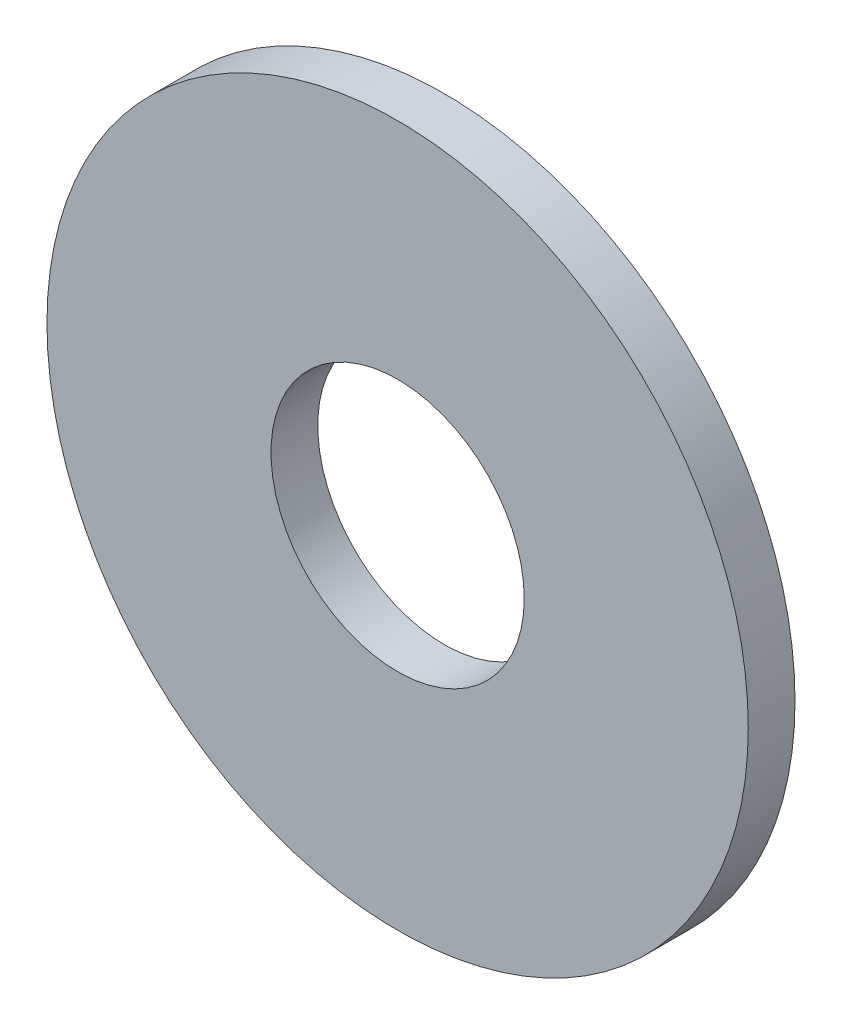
from build123d import *

# Parameters (mm, degrees)
ESQUISSE1_R      = 9
ESQUISSE1_R_2    = 3.25
EXTRUSION1_DEPTH = 1.2


with BuildPart() as part:
    # Esquisse1 → Extrusion1 (new body)
    with BuildSketch(Plane.XY):
        Circle(ESQUISSE1_R)
        Circle(ESQUISSE1_R_2, mode=Mode.SUBTRACT)
    extrude(amount=EXTRUSION1_DEPTH)


solid = part.part
